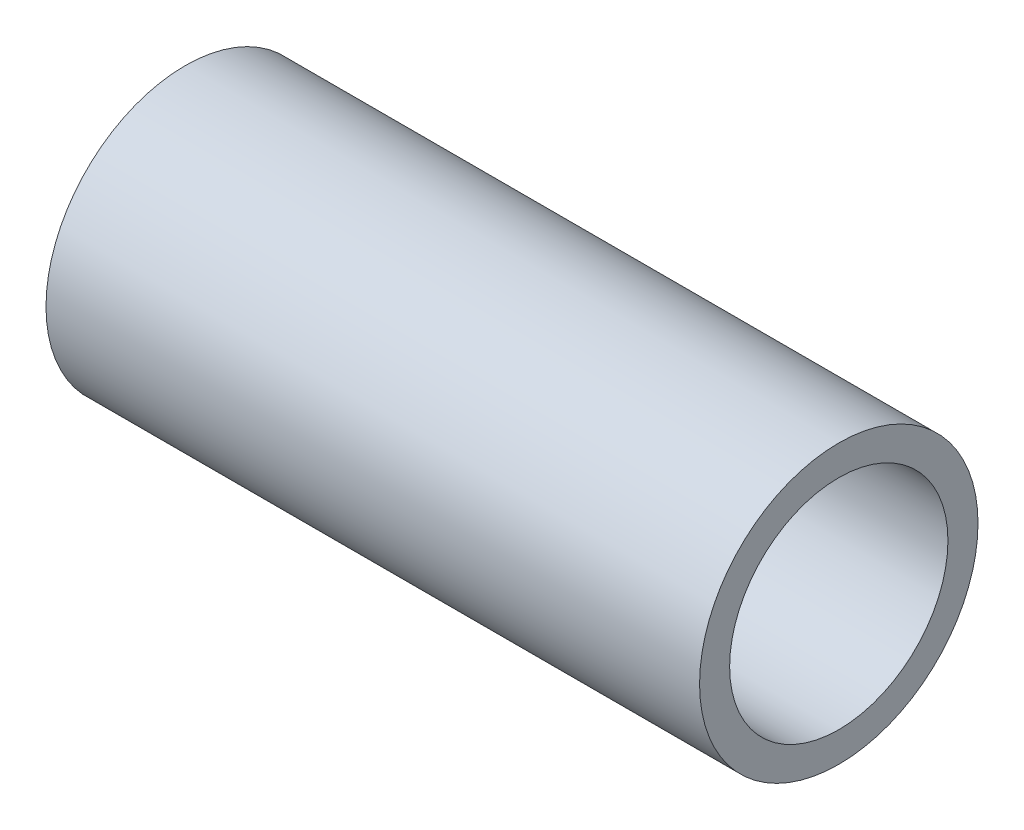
from build123d import *

# Parameters (mm, degrees)
ESQUISSE2_R   = 10.65
ESQUISSE2_R_2 = 8.35


with BuildPart() as part:
    # Balayage1: sweep along a path in Esquisse1
    with BuildLine(Plane.XY) as balayage1_path:
        Line((0, 0), (50, 0))
    # Esquisse2 → Balayage1 (sweep)
    with BuildSketch(Plane(origin=(0, 0, 0), x_dir=(0, 0, -1), z_dir=(1, 0, 0))):
        Circle(ESQUISSE2_R)
        Circle(ESQUISSE2_R_2, mode=Mode.SUBTRACT)
    sweep(path=balayage1_path.line)


solid = part.part
